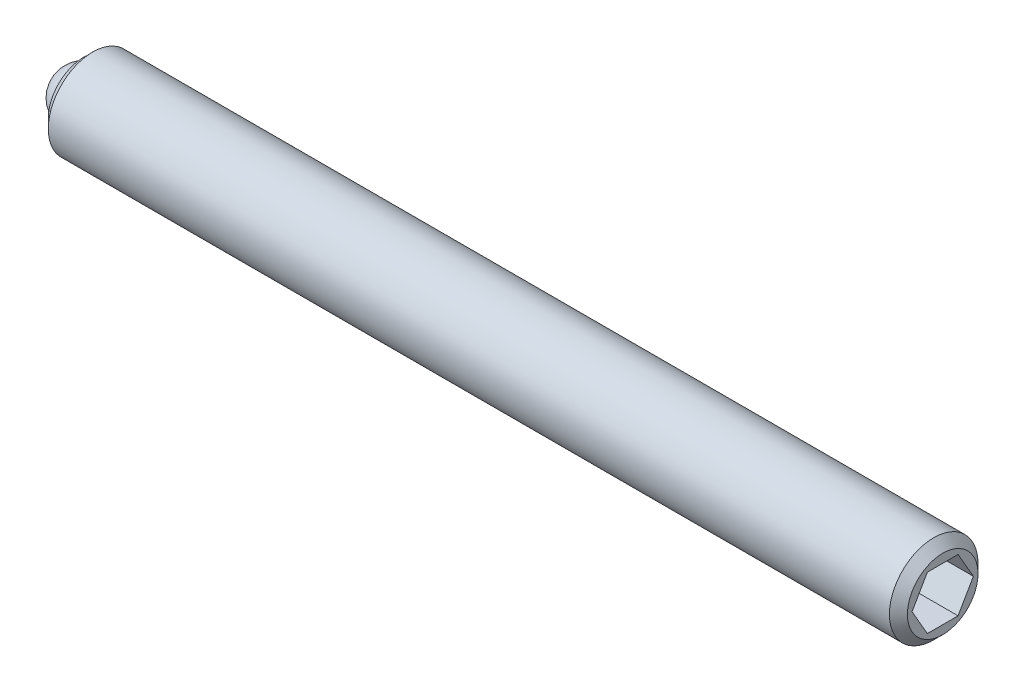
from build123d import *

# Parameters (mm, degrees)
SKETCH2_R           = 1.25
BOSS_EXTRUDE1_DEPTH = 24.25
CHAMFER1_SIZE       = 0.254
CHAMFER2_SIZE       = 0.254
CUT_EXTRUDE2_DEPTH  = 2
SKETCH3_R           = 0.75
CUT_EXTRUDE3_DEPTH  = 0.8


with BuildPart() as part:
    # Sketch2 → Boss-Extrude1 (new body)
    with BuildSketch(Plane(origin=(0, 0, 0), x_dir=(0, 0, -1), z_dir=(1, 0, 0))):
        with Locations(Location((0, 0, 0), (0, 0, 180))):
            Circle(SKETCH2_R)
    extrude(amount=BOSS_EXTRUDE1_DEPTH)

    # Chamfer1
    chamfer1_edges = [part.edges().sort_by_distance(p)[0] for p in [
        (0, 0, -1.25),
    ]]
    chamfer(chamfer1_edges, length=CHAMFER1_SIZE)

    # Chamfer2
    chamfer2_edges = [part.edges().sort_by_distance(p)[0] for p in [
        (24.25, 0, -1.25),
    ]]
    chamfer(chamfer2_edges, length=CHAMFER2_SIZE)

    # Sketch4 → Cut-Extrude2 (cut)
    with BuildSketch(Plane(origin=(24.25, 0, 0), x_dir=(0, 0, -1), z_dir=(1, 0, 0))):
        Polygon((0.866025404, 0), (0.433012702, 0.75), (-0.433012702, 0.75), (-0.866025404, 0), (-0.433012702, -0.75), (0.433012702, -0.75), align=None)
    extrude(amount=-CUT_EXTRUDE2_DEPTH, mode=Mode.SUBTRACT)

    # Sketch3 → Cut-Extrude3 (cut)
    with BuildSketch(Plane.ZY):
        Circle(SKETCH3_R)
    extrude(amount=-CUT_EXTRUDE3_DEPTH, mode=Mode.SUBTRACT)


with BuildPart() as body_2:
    # Sketch5 → Revolve1 (revolve)
    with BuildSketch(Plane.ZY):
        with BuildLine():
            Line((0, 0), (0, -0.75))
            ThreePointArc((0, -0.75), (-0.75, 0), (0, 0.75))
            Line((0, 0.75), (0, 0))
        make_face()
    revolve(axis=Axis((0, 0, 0), (0, 1, 0)))


solid = Compound([part.part, body_2.part])
